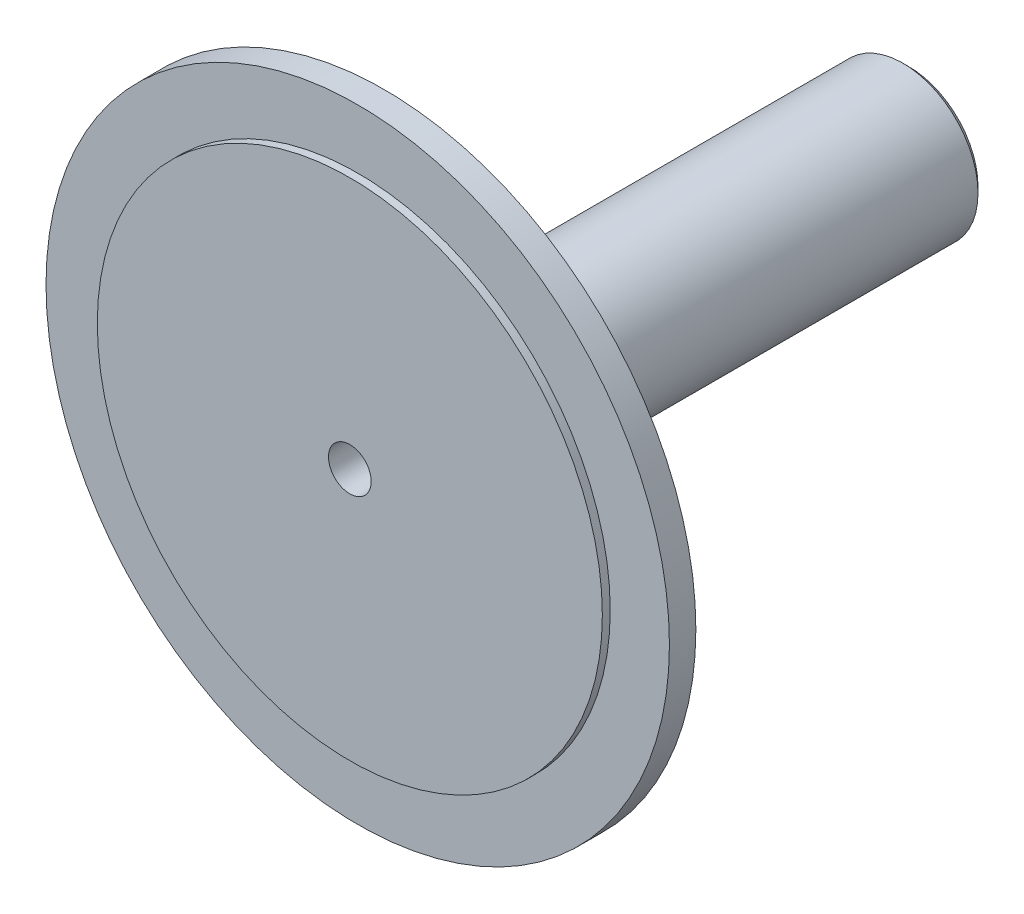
from build123d import *

# Parameters (mm, degrees)
PAH1_SIZE                   = 0.75
PAH2_SIZE                   = 3
PAH2_SIZE2                  = 5.196152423
F_1_4_28_DI_LI_DELIK1_D     = 5.4102
F_1_4_28_DI_LI_DELIK1_DEPTH = 19
F_1_4_28_DI_LI_DELIK1_TIP   = 1.625388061


with BuildPart() as part:
    # izim1 → D_nd_r1 (revolve)
    with BuildSketch(Plane(origin=(0, 0, 0), x_dir=(1, 0, 0), z_dir=(0, 1, 0)), mode=Mode.PRIVATE) as d_nd_r1_sk:
        Polygon((0, 0), (0, 70.85), (-9.5, 70.85), (-9.5, 7.35), (-39.5, 7.35), (-39.5, 1), (-32, 1), (-32, 0), align=None)
    revolve(d_nd_r1_sk.sketch.rotate(Axis((0, 0, 0), (0, 0, -1)), 180), axis=Axis((0, 0, 0), (0, 0, -1)))

    # Pah1
    pah1_edges = [part.edges().sort_by_distance(p)[0] for p in [
        (-9.5, 0, -7.35),
        (-9.5, 0, -70.85),
    ]]
    chamfer(pah1_edges, length=PAH1_SIZE)

    # Pah2
    pah2_edges = [part.edges().sort_by_distance(p)[0] for p in [
        (-39.5, 0, -7.35),
    ]]
    pah2_side = [part.faces().sort_by_distance(p)[0] for p in [
        (-39.5, 0, -4.175),
    ]]
    chamfer(pah2_edges, length=PAH2_SIZE, length2=PAH2_SIZE2, reference=pah2_side[0])

    # 1_4-28 Di_li Delik1
    with Locations(Plane.XY):
        with Locations((0, 0)):
            Hole(F_1_4_28_DI_LI_DELIK1_D / 2, depth=F_1_4_28_DI_LI_DELIK1_DEPTH)
            with Locations((0, 0, -(F_1_4_28_DI_LI_DELIK1_DEPTH + F_1_4_28_DI_LI_DELIK1_TIP / 2))):  # 118° drill point
                Cone(0, F_1_4_28_DI_LI_DELIK1_D / 2, F_1_4_28_DI_LI_DELIK1_TIP, mode=Mode.SUBTRACT)


solid = part.part
